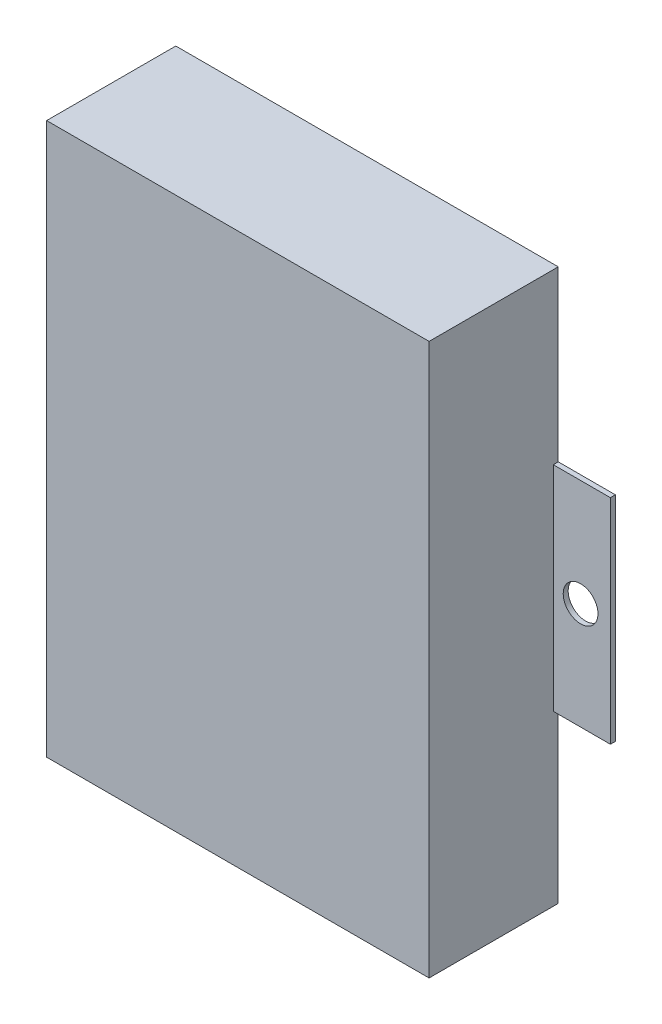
ISO-10303-21;
HEADER;
FILE_DESCRIPTION(('STEP AP214'),'2;1');
FILE_NAME('part.step','',(''),(''),'','','');
FILE_SCHEMA(('AUTOMOTIVE_DESIGN { 1 0 10303 214 1 1 1 1 }'));
ENDSEC;
DATA;
#1=APPLICATION_CONTEXT('core data for automotive mechanical design processes');
#2=APPLICATION_PROTOCOL_DEFINITION('international standard','automotive_design',2000,#1);
#3=PRODUCT_CONTEXT('',#1,'mechanical');
#4=PRODUCT('Part','Part','',(#3));
#5=PRODUCT_RELATED_PRODUCT_CATEGORY('part','',(#4));
#6=PRODUCT_DEFINITION_FORMATION('','',#4);
#7=PRODUCT_DEFINITION_CONTEXT('part definition',#1,'design');
#8=PRODUCT_DEFINITION('design','',#6,#7);
#9=PRODUCT_DEFINITION_SHAPE('','',#8);
#10=(LENGTH_UNIT() NAMED_UNIT(*) SI_UNIT(.MILLI.,.METRE.));
#11=(NAMED_UNIT(*) PLANE_ANGLE_UNIT() SI_UNIT($,.RADIAN.));
#12=(NAMED_UNIT(*) SI_UNIT($,.STERADIAN.) SOLID_ANGLE_UNIT());
#13=UNCERTAINTY_MEASURE_WITH_UNIT(LENGTH_MEASURE(1.E-05),#10,'distance_accuracy_value','');
#14=(GEOMETRIC_REPRESENTATION_CONTEXT(3) GLOBAL_UNCERTAINTY_ASSIGNED_CONTEXT((#13)) GLOBAL_UNIT_ASSIGNED_CONTEXT((#10,
#11,#12)) REPRESENTATION_CONTEXT('',''));
#15=CARTESIAN_POINT('',(0.,0.,0.));
#16=DIRECTION('',(0.,0.,1.));
#17=DIRECTION('',(1.,0.,0.));
#18=AXIS2_PLACEMENT_3D('',#15,#16,#17);
#19=CARTESIAN_POINT('',(0.,0.,26.));
#20=DIRECTION('',(1.,0.,0.));
#21=DIRECTION('',(0.,1.,0.));
#22=AXIS2_PLACEMENT_3D('',#19,#20,#21);
#23=PLANE('',#22);
#24=DIRECTION('',(0.,0.,-1.));
#25=VECTOR('',#24,1.);
#26=CARTESIAN_POINT('',(0.,77.,1.));
#27=LINE('',#26,#25);
#28=CARTESIAN_POINT('',(0.,77.,1.));
#29=VERTEX_POINT('',#28);
#30=CARTESIAN_POINT('',(0.,77.,0.));
#31=VERTEX_POINT('',#30);
#32=EDGE_CURVE('E144',#29,#31,#27,.T.);
#33=ORIENTED_EDGE('',*,*,#32,.F.);
#34=DIRECTION('',(0.,-1.,0.));
#35=VECTOR('',#34,1.);
#36=CARTESIAN_POINT('',(0.,77.,1.));
#37=LINE('',#36,#35);
#38=CARTESIAN_POINT('',(0.,34.,1.));
#39=VERTEX_POINT('',#38);
#40=EDGE_CURVE('E137',#29,#39,#37,.T.);
#41=ORIENTED_EDGE('',*,*,#40,.T.);
#42=DIRECTION('',(0.,0.,-1.));
#43=VECTOR('',#42,1.);
#44=CARTESIAN_POINT('',(0.,34.,1.));
#45=LINE('',#44,#43);
#46=CARTESIAN_POINT('',(0.,34.,0.));
#47=VERTEX_POINT('',#46);
#48=EDGE_CURVE('E123',#39,#47,#45,.T.);
#49=ORIENTED_EDGE('',*,*,#48,.T.);
#50=DIRECTION('',(0.,-1.,0.));
#51=VECTOR('',#50,1.);
#52=CARTESIAN_POINT('',(0.,0.,0.));
#53=LINE('',#52,#51);
#54=CARTESIAN_POINT('',(0.,0.,0.));
#55=VERTEX_POINT('',#54);
#56=EDGE_CURVE('E210',#47,#55,#53,.T.);
#57=ORIENTED_EDGE('',*,*,#56,.T.);
#58=DIRECTION('',(0.,0.,-1.));
#59=VECTOR('',#58,1.);
#60=CARTESIAN_POINT('',(0.,0.,26.));
#61=LINE('',#60,#59);
#62=CARTESIAN_POINT('',(0.,0.,26.));
#63=VERTEX_POINT('',#62);
#64=EDGE_CURVE('E11',#63,#55,#61,.T.);
#65=ORIENTED_EDGE('',*,*,#64,.F.);
#66=DIRECTION('',(0.,-1.,0.));
#67=VECTOR('',#66,1.);
#68=CARTESIAN_POINT('',(0.,0.,26.));
#69=LINE('',#68,#67);
#70=CARTESIAN_POINT('',(0.,111.,26.));
#71=VERTEX_POINT('',#70);
#72=EDGE_CURVE('E202',#71,#63,#69,.T.);
#73=ORIENTED_EDGE('',*,*,#72,.F.);
#74=DIRECTION('',(0.,0.,-1.));
#75=VECTOR('',#74,1.);
#76=CARTESIAN_POINT('',(0.,111.,26.));
#77=LINE('',#76,#75);
#78=CARTESIAN_POINT('',(0.,111.,0.));
#79=VERTEX_POINT('',#78);
#80=EDGE_CURVE('E243',#71,#79,#77,.T.);
#81=ORIENTED_EDGE('',*,*,#80,.T.);
#82=EDGE_CURVE('E217',#79,#31,#53,.T.);
#83=ORIENTED_EDGE('',*,*,#82,.T.);
#84=EDGE_LOOP('',(#33,#41,#49,#57,#65,#73,#81,#83));
#85=FACE_BOUND('',#84,.T.);
#86=ADVANCED_FACE('F35',(#85),#23,.F.);
#87=CARTESIAN_POINT('',(77.,0.,26.));
#88=DIRECTION('',(-1.,0.,0.));
#89=DIRECTION('',(0.,-1.,0.));
#90=AXIS2_PLACEMENT_3D('',#87,#88,#89);
#91=PLANE('',#90);
#92=DIRECTION('',(0.,0.,-1.));
#93=VECTOR('',#92,1.);
#94=CARTESIAN_POINT('',(77.,34.,1.));
#95=LINE('',#94,#93);
#96=CARTESIAN_POINT('',(77.,34.,1.));
#97=VERTEX_POINT('',#96);
#98=CARTESIAN_POINT('',(77.,34.,0.));
#99=VERTEX_POINT('',#98);
#100=EDGE_CURVE('E197',#97,#99,#95,.T.);
#101=ORIENTED_EDGE('',*,*,#100,.F.);
#102=DIRECTION('',(0.,1.,0.));
#103=VECTOR('',#102,1.);
#104=CARTESIAN_POINT('',(77.,77.,1.));
#105=LINE('',#104,#103);
#106=CARTESIAN_POINT('',(77.,77.,1.));
#107=VERTEX_POINT('',#106);
#108=EDGE_CURVE('E178',#97,#107,#105,.T.);
#109=ORIENTED_EDGE('',*,*,#108,.T.);
#110=DIRECTION('',(0.,0.,-1.));
#111=VECTOR('',#110,1.);
#112=CARTESIAN_POINT('',(77.,77.,1.));
#113=LINE('',#112,#111);
#114=CARTESIAN_POINT('',(77.,77.,0.));
#115=VERTEX_POINT('',#114);
#116=EDGE_CURVE('E191',#107,#115,#113,.T.);
#117=ORIENTED_EDGE('',*,*,#116,.T.);
#118=DIRECTION('',(0.,1.,0.));
#119=VECTOR('',#118,1.);
#120=CARTESIAN_POINT('',(77.,0.,0.));
#121=LINE('',#120,#119);
#122=CARTESIAN_POINT('',(77.,111.,0.));
#123=VERTEX_POINT('',#122);
#124=EDGE_CURVE('E228',#115,#123,#121,.T.);
#125=ORIENTED_EDGE('',*,*,#124,.T.);
#126=DIRECTION('',(0.,0.,-1.));
#127=VECTOR('',#126,1.);
#128=CARTESIAN_POINT('',(77.,111.,26.));
#129=LINE('',#128,#127);
#130=CARTESIAN_POINT('',(77.,111.,26.));
#131=VERTEX_POINT('',#130);
#132=EDGE_CURVE('E241',#131,#123,#129,.T.);
#133=ORIENTED_EDGE('',*,*,#132,.F.);
#134=DIRECTION('',(0.,1.,0.));
#135=VECTOR('',#134,1.);
#136=CARTESIAN_POINT('',(77.,0.,26.));
#137=LINE('',#136,#135);
#138=CARTESIAN_POINT('',(77.,0.,26.));
#139=VERTEX_POINT('',#138);
#140=EDGE_CURVE('E248',#139,#131,#137,.T.);
#141=ORIENTED_EDGE('',*,*,#140,.F.);
#142=DIRECTION('',(0.,0.,-1.));
#143=VECTOR('',#142,1.);
#144=CARTESIAN_POINT('',(77.,0.,26.));
#145=LINE('',#144,#143);
#146=CARTESIAN_POINT('',(77.,0.,0.));
#147=VERTEX_POINT('',#146);
#148=EDGE_CURVE('E43',#139,#147,#145,.T.);
#149=ORIENTED_EDGE('',*,*,#148,.T.);
#150=EDGE_CURVE('E236',#147,#99,#121,.T.);
#151=ORIENTED_EDGE('',*,*,#150,.T.);
#152=EDGE_LOOP('',(#101,#109,#117,#125,#133,#141,#149,#151));
#153=FACE_BOUND('',#152,.T.);
#154=ADVANCED_FACE('F292',(#153),#91,.F.);
#155=CARTESIAN_POINT('',(0.,0.,26.));
#156=DIRECTION('',(0.,1.,0.));
#157=DIRECTION('',(0.,0.,1.));
#158=AXIS2_PLACEMENT_3D('',#155,#156,#157);
#159=PLANE('',#158);
#160=DIRECTION('',(1.,0.,0.));
#161=VECTOR('',#160,1.);
#162=CARTESIAN_POINT('',(0.,0.,0.));
#163=LINE('',#162,#161);
#164=EDGE_CURVE('E220',#55,#147,#163,.T.);
#165=ORIENTED_EDGE('',*,*,#164,.T.);
#166=ORIENTED_EDGE('',*,*,#148,.F.);
#167=DIRECTION('',(1.,0.,0.));
#168=VECTOR('',#167,1.);
#169=CARTESIAN_POINT('',(0.,0.,26.));
#170=LINE('',#169,#168);
#171=EDGE_CURVE('E252',#63,#139,#170,.T.);
#172=ORIENTED_EDGE('',*,*,#171,.F.);
#173=ORIENTED_EDGE('',*,*,#64,.T.);
#174=EDGE_LOOP('',(#165,#166,#172,#173));
#175=FACE_BOUND('',#174,.T.);
#176=ADVANCED_FACE('F296',(#175),#159,.F.);
#177=CARTESIAN_POINT('',(0.,111.,26.));
#178=DIRECTION('',(0.,-1.,0.));
#179=DIRECTION('',(1.,0.,0.));
#180=AXIS2_PLACEMENT_3D('',#177,#178,#179);
#181=PLANE('',#180);
#182=DIRECTION('',(-1.,0.,0.));
#183=VECTOR('',#182,1.);
#184=CARTESIAN_POINT('',(0.,111.,0.));
#185=LINE('',#184,#183);
#186=EDGE_CURVE('E231',#123,#79,#185,.T.);
#187=ORIENTED_EDGE('',*,*,#186,.T.);
#188=ORIENTED_EDGE('',*,*,#80,.F.);
#189=DIRECTION('',(-1.,0.,0.));
#190=VECTOR('',#189,1.);
#191=CARTESIAN_POINT('',(0.,111.,26.));
#192=LINE('',#191,#190);
#193=EDGE_CURVE('E224',#131,#71,#192,.T.);
#194=ORIENTED_EDGE('',*,*,#193,.F.);
#195=ORIENTED_EDGE('',*,*,#132,.T.);
#196=EDGE_LOOP('',(#187,#188,#194,#195));
#197=FACE_BOUND('',#196,.T.);
#198=ADVANCED_FACE('F259',(#197),#181,.F.);
#199=CARTESIAN_POINT('',(0.,111.,26.));
#200=DIRECTION('',(0.,0.,-1.));
#201=DIRECTION('',(-1.,0.,0.));
#202=AXIS2_PLACEMENT_3D('',#199,#200,#201);
#203=PLANE('',#202);
#204=ORIENTED_EDGE('',*,*,#72,.T.);
#205=ORIENTED_EDGE('',*,*,#171,.T.);
#206=ORIENTED_EDGE('',*,*,#140,.T.);
#207=ORIENTED_EDGE('',*,*,#193,.T.);
#208=EDGE_LOOP('',(#204,#205,#206,#207));
#209=FACE_BOUND('',#208,.T.);
#210=ADVANCED_FACE('F280',(#209),#203,.F.);
#211=CARTESIAN_POINT('',(0.,111.,0.));
#212=DIRECTION('',(0.,0.,-1.));
#213=DIRECTION('',(-1.,0.,0.));
#214=AXIS2_PLACEMENT_3D('',#211,#212,#213);
#215=PLANE('',#214);
#216=ORIENTED_EDGE('',*,*,#82,.F.);
#217=ORIENTED_EDGE('',*,*,#186,.F.);
#218=ORIENTED_EDGE('',*,*,#124,.F.);
#219=DIRECTION('',(1.,0.,0.));
#220=VECTOR('',#219,1.);
#221=CARTESIAN_POINT('',(77.,77.,0.));
#222=LINE('',#221,#220);
#223=CARTESIAN_POINT('',(88.5,77.,0.));
#224=VERTEX_POINT('',#223);
#225=EDGE_CURVE('E59',#115,#224,#222,.T.);
#226=ORIENTED_EDGE('',*,*,#225,.T.);
#227=DIRECTION('',(0.,-1.,0.));
#228=VECTOR('',#227,1.);
#229=CARTESIAN_POINT('',(88.5,77.,0.));
#230=LINE('',#229,#228);
#231=CARTESIAN_POINT('',(88.5,34.,0.));
#232=VERTEX_POINT('',#231);
#233=EDGE_CURVE('E192',#224,#232,#230,.T.);
#234=ORIENTED_EDGE('',*,*,#233,.T.);
#235=DIRECTION('',(-1.,0.,0.));
#236=VECTOR('',#235,1.);
#237=CARTESIAN_POINT('',(77.,34.,0.));
#238=LINE('',#237,#236);
#239=EDGE_CURVE('E182',#232,#99,#238,.T.);
#240=ORIENTED_EDGE('',*,*,#239,.T.);
#241=ORIENTED_EDGE('',*,*,#150,.F.);
#242=ORIENTED_EDGE('',*,*,#164,.F.);
#243=ORIENTED_EDGE('',*,*,#56,.F.);
#244=DIRECTION('',(-1.,0.,0.));
#245=VECTOR('',#244,1.);
#246=CARTESIAN_POINT('',(0.,34.,0.));
#247=LINE('',#246,#245);
#248=CARTESIAN_POINT('',(-11.5,34.,0.));
#249=VERTEX_POINT('',#248);
#250=EDGE_CURVE('E51',#47,#249,#247,.T.);
#251=ORIENTED_EDGE('',*,*,#250,.T.);
#252=DIRECTION('',(0.,1.,0.));
#253=VECTOR('',#252,1.);
#254=CARTESIAN_POINT('',(-11.5,77.,0.));
#255=LINE('',#254,#253);
#256=CARTESIAN_POINT('',(-11.5,77.,0.));
#257=VERTEX_POINT('',#256);
#258=EDGE_CURVE('E148',#249,#257,#255,.T.);
#259=ORIENTED_EDGE('',*,*,#258,.T.);
#260=DIRECTION('',(1.,0.,0.));
#261=VECTOR('',#260,1.);
#262=CARTESIAN_POINT('',(0.,77.,0.));
#263=LINE('',#262,#261);
#264=EDGE_CURVE('E145',#257,#31,#263,.T.);
#265=ORIENTED_EDGE('',*,*,#264,.T.);
#266=EDGE_LOOP('',(#216,#217,#218,#226,#234,#240,#241,#242,#243,#251,#259,#265));
#267=FACE_BOUND('',#266,.T.);
#268=CARTESIAN_POINT('',(82.5,55.5,0.));
#269=DIRECTION('',(0.,0.,-1.));
#270=DIRECTION('',(-1.,0.,0.));
#271=AXIS2_PLACEMENT_3D('',#268,#269,#270);
#272=CIRCLE('',#271,3.50000000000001);
#273=CARTESIAN_POINT('',(79.,55.5,0.));
#274=VERTEX_POINT('',#273);
#275=EDGE_CURVE('E169',#274,#274,#272,.T.);
#276=ORIENTED_EDGE('',*,*,#275,.F.);
#277=EDGE_LOOP('',(#276));
#278=FACE_BOUND('',#277,.T.);
#279=CARTESIAN_POINT('',(-5.50000000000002,55.5,0.));
#280=DIRECTION('',(0.,0.,-1.));
#281=DIRECTION('',(-1.,0.,0.));
#282=AXIS2_PLACEMENT_3D('',#279,#280,#281);
#283=CIRCLE('',#282,3.50000000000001);
#284=CARTESIAN_POINT('',(-9.00000000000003,55.5,0.));
#285=VERTEX_POINT('',#284);
#286=EDGE_CURVE('E150',#285,#285,#283,.T.);
#287=ORIENTED_EDGE('',*,*,#286,.F.);
#288=EDGE_LOOP('',(#287));
#289=FACE_BOUND('',#288,.T.);
#290=ADVANCED_FACE('F262',(#267,#278,#289),#215,.T.);
#291=CARTESIAN_POINT('',(77.,34.,1.));
#292=DIRECTION('',(0.,-1.,0.));
#293=DIRECTION('',(0.,0.,-1.));
#294=AXIS2_PLACEMENT_3D('',#291,#292,#293);
#295=PLANE('',#294);
#296=ORIENTED_EDGE('',*,*,#239,.F.);
#297=DIRECTION('',(0.,0.,-1.));
#298=VECTOR('',#297,1.);
#299=CARTESIAN_POINT('',(88.5,34.,1.));
#300=LINE('',#299,#298);
#301=CARTESIAN_POINT('',(88.5,34.,1.));
#302=VERTEX_POINT('',#301);
#303=EDGE_CURVE('E195',#302,#232,#300,.T.);
#304=ORIENTED_EDGE('',*,*,#303,.F.);
#305=DIRECTION('',(-1.,0.,0.));
#306=VECTOR('',#305,1.);
#307=CARTESIAN_POINT('',(77.,34.,1.));
#308=LINE('',#307,#306);
#309=EDGE_CURVE('E188',#302,#97,#308,.T.);
#310=ORIENTED_EDGE('',*,*,#309,.T.);
#311=ORIENTED_EDGE('',*,*,#100,.T.);
#312=EDGE_LOOP('',(#296,#304,#310,#311));
#313=FACE_BOUND('',#312,.T.);
#314=ADVANCED_FACE('F279',(#313),#295,.T.);
#315=CARTESIAN_POINT('',(88.5,77.,1.));
#316=DIRECTION('',(1.,0.,0.));
#317=DIRECTION('',(0.,1.,0.));
#318=AXIS2_PLACEMENT_3D('',#315,#316,#317);
#319=PLANE('',#318);
#320=ORIENTED_EDGE('',*,*,#233,.F.);
#321=DIRECTION('',(0.,0.,-1.));
#322=VECTOR('',#321,1.);
#323=CARTESIAN_POINT('',(88.5,77.,1.));
#324=LINE('',#323,#322);
#325=CARTESIAN_POINT('',(88.5,77.,1.));
#326=VERTEX_POINT('',#325);
#327=EDGE_CURVE('E198',#326,#224,#324,.T.);
#328=ORIENTED_EDGE('',*,*,#327,.F.);
#329=DIRECTION('',(0.,-1.,0.));
#330=VECTOR('',#329,1.);
#331=CARTESIAN_POINT('',(88.5,77.,1.));
#332=LINE('',#331,#330);
#333=EDGE_CURVE('E185',#326,#302,#332,.T.);
#334=ORIENTED_EDGE('',*,*,#333,.T.);
#335=ORIENTED_EDGE('',*,*,#303,.T.);
#336=EDGE_LOOP('',(#320,#328,#334,#335));
#337=FACE_BOUND('',#336,.T.);
#338=ADVANCED_FACE('F286',(#337),#319,.T.);
#339=CARTESIAN_POINT('',(77.,77.,1.));
#340=DIRECTION('',(0.,1.,0.));
#341=DIRECTION('',(-1.,0.,0.));
#342=AXIS2_PLACEMENT_3D('',#339,#340,#341);
#343=PLANE('',#342);
#344=ORIENTED_EDGE('',*,*,#225,.F.);
#345=ORIENTED_EDGE('',*,*,#116,.F.);
#346=DIRECTION('',(1.,0.,0.));
#347=VECTOR('',#346,1.);
#348=CARTESIAN_POINT('',(77.,77.,1.));
#349=LINE('',#348,#347);
#350=EDGE_CURVE('E181',#107,#326,#349,.T.);
#351=ORIENTED_EDGE('',*,*,#350,.T.);
#352=ORIENTED_EDGE('',*,*,#327,.T.);
#353=EDGE_LOOP('',(#344,#345,#351,#352));
#354=FACE_BOUND('',#353,.T.);
#355=ADVANCED_FACE('F342',(#354),#343,.T.);
#356=CARTESIAN_POINT('',(77.,34.,1.));
#357=DIRECTION('',(0.,0.,1.));
#358=DIRECTION('',(1.,0.,0.));
#359=AXIS2_PLACEMENT_3D('',#356,#357,#358);
#360=PLANE('',#359);
#361=CARTESIAN_POINT('',(82.5,55.5,1.));
#362=DIRECTION('',(0.,0.,-1.));
#363=DIRECTION('',(-1.,0.,0.));
#364=AXIS2_PLACEMENT_3D('',#361,#362,#363);
#365=CIRCLE('',#364,3.50000000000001);
#366=CARTESIAN_POINT('',(79.,55.5,1.));
#367=VERTEX_POINT('',#366);
#368=EDGE_CURVE('E162',#367,#367,#365,.T.);
#369=ORIENTED_EDGE('',*,*,#368,.T.);
#370=EDGE_LOOP('',(#369));
#371=FACE_BOUND('',#370,.T.);
#372=ORIENTED_EDGE('',*,*,#108,.F.);
#373=ORIENTED_EDGE('',*,*,#309,.F.);
#374=ORIENTED_EDGE('',*,*,#333,.F.);
#375=ORIENTED_EDGE('',*,*,#350,.F.);
#376=EDGE_LOOP('',(#372,#373,#374,#375));
#377=FACE_BOUND('',#376,.T.);
#378=ADVANCED_FACE('F352',(#371,#377),#360,.T.);
#379=CARTESIAN_POINT('',(82.5,55.5,1.));
#380=DIRECTION('',(0.,0.,-1.));
#381=DIRECTION('',(-1.,0.,0.));
#382=AXIS2_PLACEMENT_3D('',#379,#380,#381);
#383=CYLINDRICAL_SURFACE('',#382,3.50000000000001);
#384=ORIENTED_EDGE('',*,*,#368,.F.);
#385=EDGE_LOOP('',(#384));
#386=FACE_BOUND('',#385,.T.);
#387=ORIENTED_EDGE('',*,*,#275,.T.);
#388=EDGE_LOOP('',(#387));
#389=FACE_BOUND('',#388,.T.);
#390=ADVANCED_FACE('F361',(#386,#389),#383,.F.);
#391=CARTESIAN_POINT('',(0.,77.,1.));
#392=DIRECTION('',(0.,1.,0.));
#393=DIRECTION('',(0.,0.,1.));
#394=AXIS2_PLACEMENT_3D('',#391,#392,#393);
#395=PLANE('',#394);
#396=ORIENTED_EDGE('',*,*,#264,.F.);
#397=DIRECTION('',(0.,0.,-1.));
#398=VECTOR('',#397,1.);
#399=CARTESIAN_POINT('',(-11.5,77.,1.));
#400=LINE('',#399,#398);
#401=CARTESIAN_POINT('',(-11.5,77.,1.));
#402=VERTEX_POINT('',#401);
#403=EDGE_CURVE('E157',#402,#257,#400,.T.);
#404=ORIENTED_EDGE('',*,*,#403,.F.);
#405=DIRECTION('',(1.,0.,0.));
#406=VECTOR('',#405,1.);
#407=CARTESIAN_POINT('',(0.,77.,1.));
#408=LINE('',#407,#406);
#409=EDGE_CURVE('E131',#402,#29,#408,.T.);
#410=ORIENTED_EDGE('',*,*,#409,.T.);
#411=ORIENTED_EDGE('',*,*,#32,.T.);
#412=EDGE_LOOP('',(#396,#404,#410,#411));
#413=FACE_BOUND('',#412,.T.);
#414=ADVANCED_FACE('F265',(#413),#395,.T.);
#415=CARTESIAN_POINT('',(-11.5,77.,1.));
#416=DIRECTION('',(-1.,0.,0.));
#417=DIRECTION('',(0.,-1.,0.));
#418=AXIS2_PLACEMENT_3D('',#415,#416,#417);
#419=PLANE('',#418);
#420=ORIENTED_EDGE('',*,*,#258,.F.);
#421=DIRECTION('',(0.,0.,-1.));
#422=VECTOR('',#421,1.);
#423=CARTESIAN_POINT('',(-11.5,34.,1.));
#424=LINE('',#423,#422);
#425=CARTESIAN_POINT('',(-11.5,34.,1.));
#426=VERTEX_POINT('',#425);
#427=EDGE_CURVE('E130',#426,#249,#424,.T.);
#428=ORIENTED_EDGE('',*,*,#427,.F.);
#429=DIRECTION('',(0.,1.,0.));
#430=VECTOR('',#429,1.);
#431=CARTESIAN_POINT('',(-11.5,77.,1.));
#432=LINE('',#431,#430);
#433=EDGE_CURVE('E140',#426,#402,#432,.T.);
#434=ORIENTED_EDGE('',*,*,#433,.T.);
#435=ORIENTED_EDGE('',*,*,#403,.T.);
#436=EDGE_LOOP('',(#420,#428,#434,#435));
#437=FACE_BOUND('',#436,.T.);
#438=ADVANCED_FACE('F267',(#437),#419,.T.);
#439=CARTESIAN_POINT('',(0.,34.,1.));
#440=DIRECTION('',(0.,-1.,0.));
#441=DIRECTION('',(0.,0.,-1.));
#442=AXIS2_PLACEMENT_3D('',#439,#440,#441);
#443=PLANE('',#442);
#444=ORIENTED_EDGE('',*,*,#250,.F.);
#445=ORIENTED_EDGE('',*,*,#48,.F.);
#446=DIRECTION('',(-1.,0.,0.));
#447=VECTOR('',#446,1.);
#448=CARTESIAN_POINT('',(0.,34.,1.));
#449=LINE('',#448,#447);
#450=EDGE_CURVE('E126',#39,#426,#449,.T.);
#451=ORIENTED_EDGE('',*,*,#450,.T.);
#452=ORIENTED_EDGE('',*,*,#427,.T.);
#453=EDGE_LOOP('',(#444,#445,#451,#452));
#454=FACE_BOUND('',#453,.T.);
#455=ADVANCED_FACE('F125',(#454),#443,.T.);
#456=CARTESIAN_POINT('',(0.,34.,1.));
#457=DIRECTION('',(0.,0.,-1.));
#458=DIRECTION('',(-1.,0.,0.));
#459=AXIS2_PLACEMENT_3D('',#456,#457,#458);
#460=PLANE('',#459);
#461=CARTESIAN_POINT('',(-5.50000000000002,55.5,1.));
#462=DIRECTION('',(0.,0.,-1.));
#463=DIRECTION('',(-1.,0.,0.));
#464=AXIS2_PLACEMENT_3D('',#461,#462,#463);
#465=CIRCLE('',#464,3.50000000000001);
#466=CARTESIAN_POINT('',(-9.00000000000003,55.5,1.));
#467=VERTEX_POINT('',#466);
#468=EDGE_CURVE('E269',#467,#467,#465,.T.);
#469=ORIENTED_EDGE('',*,*,#468,.T.);
#470=EDGE_LOOP('',(#469));
#471=FACE_BOUND('',#470,.T.);
#472=ORIENTED_EDGE('',*,*,#40,.F.);
#473=ORIENTED_EDGE('',*,*,#409,.F.);
#474=ORIENTED_EDGE('',*,*,#433,.F.);
#475=ORIENTED_EDGE('',*,*,#450,.F.);
#476=EDGE_LOOP('',(#472,#473,#474,#475));
#477=FACE_BOUND('',#476,.T.);
#478=ADVANCED_FACE('F135',(#471,#477),#460,.F.);
#479=CARTESIAN_POINT('',(-5.50000000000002,55.5,1.));
#480=DIRECTION('',(0.,0.,-1.));
#481=DIRECTION('',(-1.,0.,0.));
#482=AXIS2_PLACEMENT_3D('',#479,#480,#481);
#483=CYLINDRICAL_SURFACE('',#482,3.50000000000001);
#484=ORIENTED_EDGE('',*,*,#468,.F.);
#485=EDGE_LOOP('',(#484));
#486=FACE_BOUND('',#485,.T.);
#487=ORIENTED_EDGE('',*,*,#286,.T.);
#488=EDGE_LOOP('',(#487));
#489=FACE_BOUND('',#488,.T.);
#490=ADVANCED_FACE('F276',(#486,#489),#483,.F.);
#491=CLOSED_SHELL('',(#86,#154,#176,#198,#210,#290,#314,#338,#355,#378,#390,#414,#438,#455,#478,#490));
#492=MANIFOLD_SOLID_BREP('B2',#491);
#493=ADVANCED_BREP_SHAPE_REPRESENTATION('',(#18,#492),#14);
#494=SHAPE_DEFINITION_REPRESENTATION(#9,#493);
ENDSEC;
END-ISO-10303-21;
